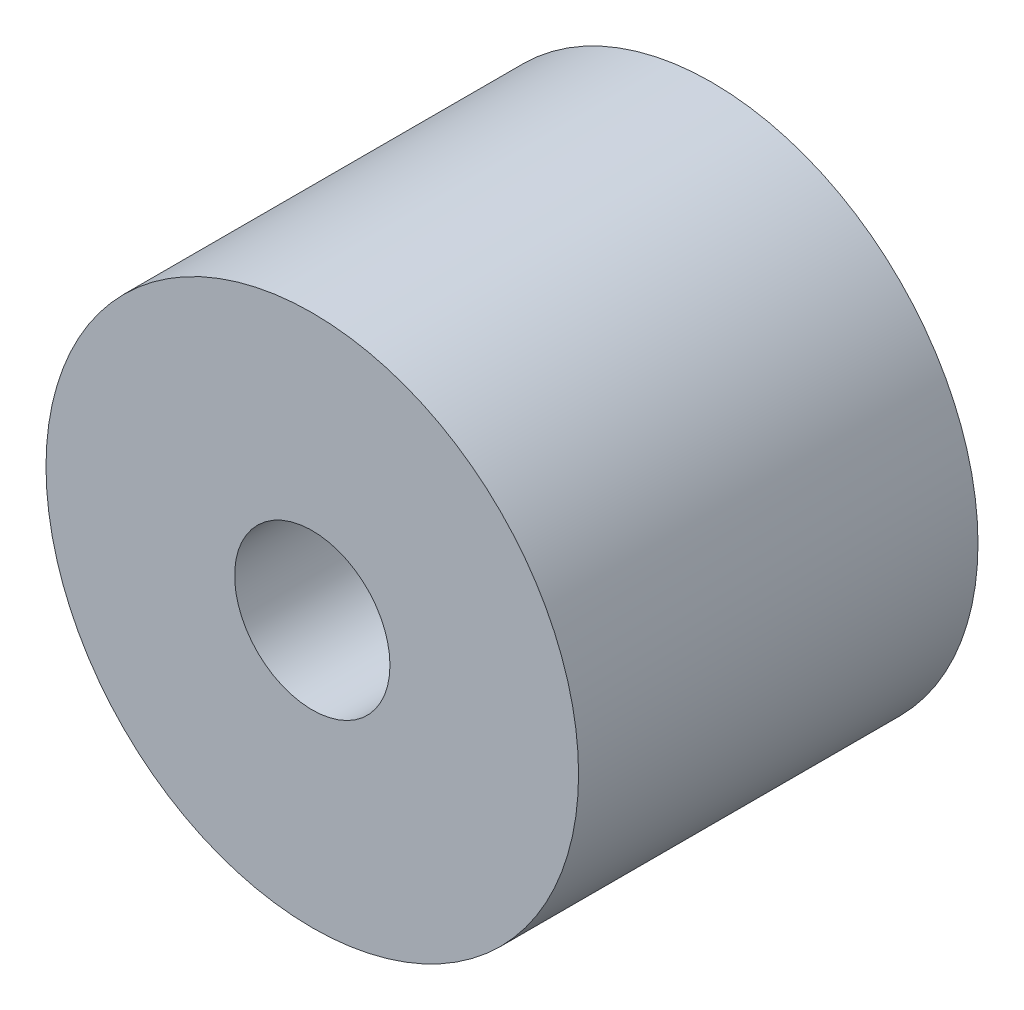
ISO-10303-21;
HEADER;
FILE_DESCRIPTION(('STEP AP214'),'2;1');
FILE_NAME('part.step','',(''),(''),'','','');
FILE_SCHEMA(('AUTOMOTIVE_DESIGN { 1 0 10303 214 1 1 1 1 }'));
ENDSEC;
DATA;
#1=APPLICATION_CONTEXT('core data for automotive mechanical design processes');
#2=APPLICATION_PROTOCOL_DEFINITION('international standard','automotive_design',2000,#1);
#3=PRODUCT_CONTEXT('',#1,'mechanical');
#4=PRODUCT('Part','Part','',(#3));
#5=PRODUCT_RELATED_PRODUCT_CATEGORY('part','',(#4));
#6=PRODUCT_DEFINITION_FORMATION('','',#4);
#7=PRODUCT_DEFINITION_CONTEXT('part definition',#1,'design');
#8=PRODUCT_DEFINITION('design','',#6,#7);
#9=PRODUCT_DEFINITION_SHAPE('','',#8);
#10=(LENGTH_UNIT() NAMED_UNIT(*) SI_UNIT(.MILLI.,.METRE.));
#11=(NAMED_UNIT(*) PLANE_ANGLE_UNIT() SI_UNIT($,.RADIAN.));
#12=(NAMED_UNIT(*) SI_UNIT($,.STERADIAN.) SOLID_ANGLE_UNIT());
#13=UNCERTAINTY_MEASURE_WITH_UNIT(LENGTH_MEASURE(1.E-05),#10,'distance_accuracy_value','');
#14=(GEOMETRIC_REPRESENTATION_CONTEXT(3) GLOBAL_UNCERTAINTY_ASSIGNED_CONTEXT((#13)) GLOBAL_UNIT_ASSIGNED_CONTEXT((#10,
#11,#12)) REPRESENTATION_CONTEXT('',''));
#15=CARTESIAN_POINT('',(0.,0.,0.));
#16=DIRECTION('',(0.,0.,1.));
#17=DIRECTION('',(1.,0.,0.));
#18=AXIS2_PLACEMENT_3D('',#15,#16,#17);
#19=CARTESIAN_POINT('',(0.,0.,9.));
#20=DIRECTION('',(0.,0.,1.));
#21=DIRECTION('',(1.,0.,0.));
#22=AXIS2_PLACEMENT_3D('',#19,#20,#21);
#23=PLANE('',#22);
#24=CARTESIAN_POINT('',(0.,0.,9.));
#25=DIRECTION('',(0.,0.,1.));
#26=DIRECTION('',(1.,0.,0.));
#27=AXIS2_PLACEMENT_3D('',#24,#25,#26);
#28=CIRCLE('',#27,6.);
#29=CARTESIAN_POINT('',(6.,0.,9.));
#30=VERTEX_POINT('',#29);
#31=EDGE_CURVE('E10',#30,#30,#28,.T.);
#32=ORIENTED_EDGE('',*,*,#31,.T.);
#33=EDGE_LOOP('',(#32));
#34=FACE_BOUND('',#33,.T.);
#35=CARTESIAN_POINT('',(0.,0.,9.));
#36=DIRECTION('',(0.,0.,1.));
#37=DIRECTION('',(1.,0.,0.));
#38=AXIS2_PLACEMENT_3D('',#35,#36,#37);
#39=CIRCLE('',#38,1.75);
#40=CARTESIAN_POINT('',(1.75,0.,9.));
#41=VERTEX_POINT('',#40);
#42=EDGE_CURVE('E41',#41,#41,#39,.T.);
#43=ORIENTED_EDGE('',*,*,#42,.F.);
#44=EDGE_LOOP('',(#43));
#45=FACE_BOUND('',#44,.T.);
#46=ADVANCED_FACE('F30',(#34,#45),#23,.T.);
#47=CARTESIAN_POINT('',(0.,0.,0.));
#48=DIRECTION('',(0.,0.,1.));
#49=DIRECTION('',(1.,0.,0.));
#50=AXIS2_PLACEMENT_3D('',#47,#48,#49);
#51=PLANE('',#50);
#52=CARTESIAN_POINT('',(0.,0.,0.));
#53=DIRECTION('',(0.,0.,1.));
#54=DIRECTION('',(1.,0.,0.));
#55=AXIS2_PLACEMENT_3D('',#52,#53,#54);
#56=CIRCLE('',#55,6.);
#57=CARTESIAN_POINT('',(6.,0.,0.));
#58=VERTEX_POINT('',#57);
#59=EDGE_CURVE('E34',#58,#58,#56,.T.);
#60=ORIENTED_EDGE('',*,*,#59,.F.);
#61=EDGE_LOOP('',(#60));
#62=FACE_BOUND('',#61,.T.);
#63=CARTESIAN_POINT('',(0.,0.,0.));
#64=DIRECTION('',(0.,0.,1.));
#65=DIRECTION('',(1.,0.,0.));
#66=AXIS2_PLACEMENT_3D('',#63,#64,#65);
#67=CIRCLE('',#66,1.75);
#68=CARTESIAN_POINT('',(1.75,0.,0.));
#69=VERTEX_POINT('',#68);
#70=EDGE_CURVE('E43',#69,#69,#67,.T.);
#71=ORIENTED_EDGE('',*,*,#70,.T.);
#72=EDGE_LOOP('',(#71));
#73=FACE_BOUND('',#72,.T.);
#74=ADVANCED_FACE('F53',(#62,#73),#51,.F.);
#75=CARTESIAN_POINT('',(0.,0.,9.));
#76=DIRECTION('',(0.,0.,-1.));
#77=DIRECTION('',(-1.,0.,0.));
#78=AXIS2_PLACEMENT_3D('',#75,#76,#77);
#79=CYLINDRICAL_SURFACE('',#78,6.);
#80=ORIENTED_EDGE('',*,*,#31,.F.);
#81=EDGE_LOOP('',(#80));
#82=FACE_BOUND('',#81,.T.);
#83=ORIENTED_EDGE('',*,*,#59,.T.);
#84=EDGE_LOOP('',(#83));
#85=FACE_BOUND('',#84,.T.);
#86=ADVANCED_FACE('F32',(#82,#85),#79,.T.);
#87=CARTESIAN_POINT('',(0.,0.,9.));
#88=DIRECTION('',(0.,0.,-1.));
#89=DIRECTION('',(-1.,0.,0.));
#90=AXIS2_PLACEMENT_3D('',#87,#88,#89);
#91=CYLINDRICAL_SURFACE('',#90,1.75);
#92=ORIENTED_EDGE('',*,*,#42,.T.);
#93=EDGE_LOOP('',(#92));
#94=FACE_BOUND('',#93,.T.);
#95=ORIENTED_EDGE('',*,*,#70,.F.);
#96=EDGE_LOOP('',(#95));
#97=FACE_BOUND('',#96,.T.);
#98=ADVANCED_FACE('F49',(#94,#97),#91,.F.);
#99=CLOSED_SHELL('',(#46,#74,#86,#98));
#100=MANIFOLD_SOLID_BREP('B2',#99);
#101=ADVANCED_BREP_SHAPE_REPRESENTATION('',(#18,#100),#14);
#102=SHAPE_DEFINITION_REPRESENTATION(#9,#101);
ENDSEC;
END-ISO-10303-21;
